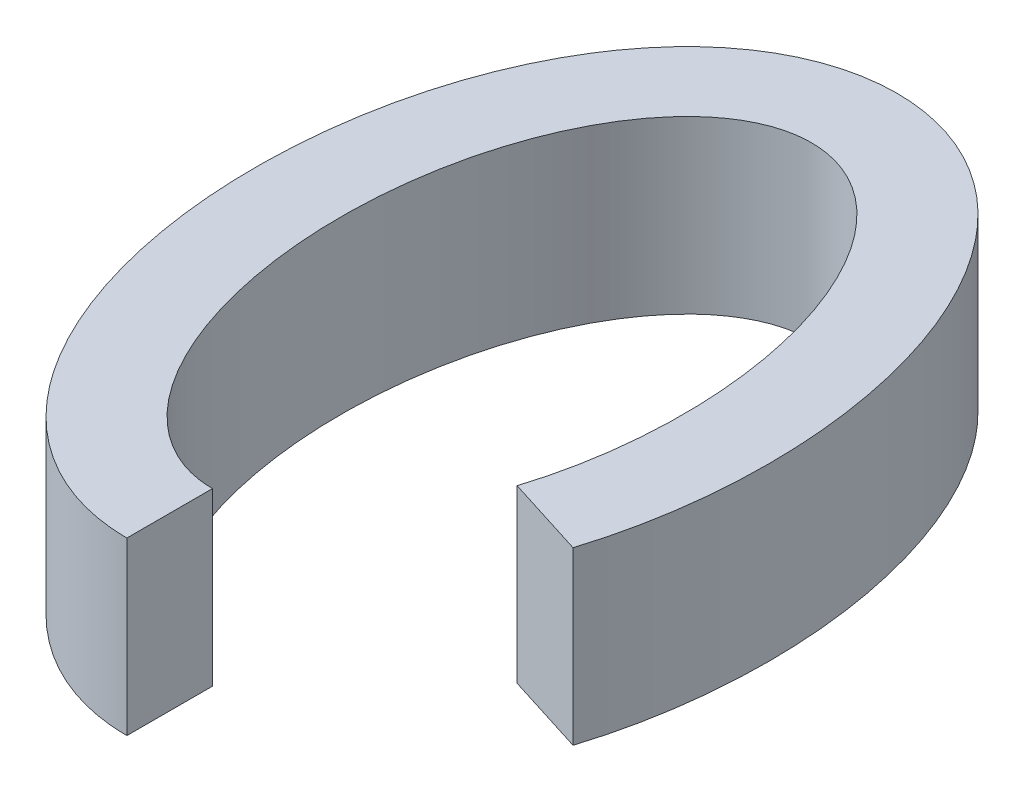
ISO-10303-21;
HEADER;
FILE_DESCRIPTION(('STEP AP214'),'2;1');
FILE_NAME('part.step','',(''),(''),'','','');
FILE_SCHEMA(('AUTOMOTIVE_DESIGN { 1 0 10303 214 1 1 1 1 }'));
ENDSEC;
DATA;
#1=APPLICATION_CONTEXT('core data for automotive mechanical design processes');
#2=APPLICATION_PROTOCOL_DEFINITION('international standard','automotive_design',2000,#1);
#3=PRODUCT_CONTEXT('',#1,'mechanical');
#4=PRODUCT('Part','Part','',(#3));
#5=PRODUCT_RELATED_PRODUCT_CATEGORY('part','',(#4));
#6=PRODUCT_DEFINITION_FORMATION('','',#4);
#7=PRODUCT_DEFINITION_CONTEXT('part definition',#1,'design');
#8=PRODUCT_DEFINITION('design','',#6,#7);
#9=PRODUCT_DEFINITION_SHAPE('','',#8);
#10=(LENGTH_UNIT() NAMED_UNIT(*) SI_UNIT(.MILLI.,.METRE.));
#11=(NAMED_UNIT(*) PLANE_ANGLE_UNIT() SI_UNIT($,.RADIAN.));
#12=(NAMED_UNIT(*) SI_UNIT($,.STERADIAN.) SOLID_ANGLE_UNIT());
#13=UNCERTAINTY_MEASURE_WITH_UNIT(LENGTH_MEASURE(1.E-05),#10,'distance_accuracy_value','');
#14=(GEOMETRIC_REPRESENTATION_CONTEXT(3) GLOBAL_UNCERTAINTY_ASSIGNED_CONTEXT((#13)) GLOBAL_UNIT_ASSIGNED_CONTEXT((#10,
#11,#12)) REPRESENTATION_CONTEXT('',''));
#15=CARTESIAN_POINT('',(0.,0.,0.));
#16=DIRECTION('',(0.,0.,1.));
#17=DIRECTION('',(1.,0.,0.));
#18=AXIS2_PLACEMENT_3D('',#15,#16,#17);
#19=CARTESIAN_POINT('',(27.0479201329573,20.,19.9173119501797));
#20=CARTESIAN_POINT('',(28.3196763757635,20.,15.8841766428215));
#21=CARTESIAN_POINT('',(29.180486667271,20.,11.602582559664));
#22=CARTESIAN_POINT('',(30.0809814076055,20.,2.85323177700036));
#23=CARTESIAN_POINT('',(30.1194336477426,20.,-1.61315339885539));
#24=CARTESIAN_POINT('',(29.3722141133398,20.,-10.3936884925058));
#25=CARTESIAN_POINT('',(28.5875556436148,20.,-14.7063774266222));
#26=CARTESIAN_POINT('',(26.1974756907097,20.,-22.8620090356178));
#27=CARTESIAN_POINT('',(24.5955267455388,20.,-26.7063630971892));
#28=CARTESIAN_POINT('',(21.534073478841,20.,-31.9105575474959));
#29=CARTESIAN_POINT('',(20.4028411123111,20.,-33.5519264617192));
#30=CARTESIAN_POINT('',(17.8969485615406,20.,-36.602957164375));
#31=CARTESIAN_POINT('',(16.5216592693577,20.,-38.0133403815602));
#32=CARTESIAN_POINT('',(13.5027838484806,20.,-40.5318010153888));
#33=CARTESIAN_POINT('',(11.8572890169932,20.,-41.6400149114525));
#34=CARTESIAN_POINT('',(8.30628481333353,20.,-43.4392087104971));
#35=CARTESIAN_POINT('',(6.39894596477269,20.,-44.1276396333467));
#36=CARTESIAN_POINT('',(3.42326957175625,20.,-44.7492157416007));
#37=CARTESIAN_POINT('',(2.41329529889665,20.,-44.888077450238));
#38=CARTESIAN_POINT('',(0.381037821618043,20.,-45.0207636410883));
#39=CARTESIAN_POINT('',(-0.641080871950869,20.,-45.0145390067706));
#40=CARTESIAN_POINT('',(-2.67112088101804,20.,-44.8573470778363));
#41=CARTESIAN_POINT('',(-3.67888150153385,20.,-44.706437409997));
#42=CARTESIAN_POINT('',(-5.65643928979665,20.,-44.269018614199));
#43=CARTESIAN_POINT('',(-6.62615460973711,20.,-43.9826357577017));
#44=CARTESIAN_POINT('',(-9.45264365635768,20.,-42.9426303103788));
#45=CARTESIAN_POINT('',(-11.2236327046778,20.,-42.0091574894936));
#46=CARTESIAN_POINT('',(-14.4886548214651,20.,-39.7912937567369));
#47=CARTESIAN_POINT('',(-15.9849950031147,20.,-38.50775706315));
#48=CARTESIAN_POINT('',(-18.7196495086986,20.,-35.682655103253));
#49=CARTESIAN_POINT('',(-19.9591312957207,20.,-34.1404315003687));
#50=CARTESIAN_POINT('',(-22.2073882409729,20.,-30.8513163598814));
#51=CARTESIAN_POINT('',(-23.2163700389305,20.,-29.1038308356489));
#52=CARTESIAN_POINT('',(-25.9227377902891,20.,-23.6101288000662));
#53=CARTESIAN_POINT('',(-27.302045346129,20.,-19.6107642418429));
#54=CARTESIAN_POINT('',(-29.2464871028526,20.,-11.2240614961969));
#55=CARTESIAN_POINT('',(-29.8087774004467,20.,-6.83666308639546));
#56=CARTESIAN_POINT('',(-30.1091362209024,20.,2.00179651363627));
#57=CARTESIAN_POINT('',(-29.846804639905,20.,6.45124289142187));
#58=CARTESIAN_POINT('',(-28.5004227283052,20.,15.0773827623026));
#59=CARTESIAN_POINT('',(-27.4182727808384,20.,19.2531068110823));
#60=CARTESIAN_POINT('',(-25.1735003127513,20.,25.0863560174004));
#61=CARTESIAN_POINT('',(-24.3213781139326,20.,26.9595110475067));
#62=CARTESIAN_POINT('',(-22.3998166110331,20.,30.5281685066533));
#63=CARTESIAN_POINT('',(-21.3304345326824,20.,32.2240254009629));
#64=CARTESIAN_POINT('',(-18.9551222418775,20.,35.3976966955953));
#65=CARTESIAN_POINT('',(-17.6488033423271,20.,36.8761838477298));
#66=CARTESIAN_POINT('',(-14.773586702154,20.,39.5539168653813));
#67=CARTESIAN_POINT('',(-13.2031476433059,20.,40.7536380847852));
#68=CARTESIAN_POINT('',(-9.79307549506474,20.,42.7713256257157));
#69=CARTESIAN_POINT('',(-7.95119787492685,20.,43.5876261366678));
#70=CARTESIAN_POINT('',(-5.04248096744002,20.,44.4248677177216));
#71=CARTESIAN_POINT('',(-4.04952848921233,20.,44.639343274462));
#72=CARTESIAN_POINT('',(-2.03765905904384,20.,44.9269580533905));
#73=CARTESIAN_POINT('',(-1.01887306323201,20.,45.));
#74=CARTESIAN_POINT('',(0.,20.,45.));
#75=B_SPLINE_CURVE_WITH_KNOTS('',3,(#19,#20,#21,#22,#23,#24,#25,#26,#27,#28,#29,#30,#31,#32,#33,
#34,#35,#36,#37,#38,#39,#40,#41,#42,#43,#44,#45,#46,#47,#48,#49,#50,#51,#52,#53,#54,#55,#56,#57,
#58,#59,#60,#61,#62,#63,#64,#65,#66,#67,#68,#69,#70,#71,#72,#73,#74),.UNSPECIFIED.,.F.,.F.,(4,2,
2,2,2,2,2,2,2,2,2,2,2,2,2,2,2,2,2,2,2,2,2,2,2,2,2,4),(0.,0.0624999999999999,0.125,0.1875,0.25,
0.28125,0.3125,0.34375,0.375,0.390625,0.40625,0.421875,0.4375,0.46875,0.5,0.53125,0.5625,0.625,
0.6875,0.75,0.8125,0.84375,0.875,0.90625,0.9375,0.96875,0.984375,1.),.UNSPECIFIED.);
#76=DIRECTION('',(0.,-1.,0.));
#77=VECTOR('',#76,1.);
#78=SURFACE_OF_LINEAR_EXTRUSION('',#75,#77);
#79=CARTESIAN_POINT('',(27.0479201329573,0.,19.9173119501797));
#80=CARTESIAN_POINT('',(28.3196763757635,0.,15.8841766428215));
#81=CARTESIAN_POINT('',(29.180486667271,0.,11.602582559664));
#82=CARTESIAN_POINT('',(30.0809814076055,0.,2.85323177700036));
#83=CARTESIAN_POINT('',(30.1194336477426,0.,-1.61315339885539));
#84=CARTESIAN_POINT('',(29.3722141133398,0.,-10.3936884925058));
#85=CARTESIAN_POINT('',(28.5875556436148,0.,-14.7063774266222));
#86=CARTESIAN_POINT('',(26.1974756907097,0.,-22.8620090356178));
#87=CARTESIAN_POINT('',(24.5955267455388,0.,-26.7063630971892));
#88=CARTESIAN_POINT('',(21.534073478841,0.,-31.9105575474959));
#89=CARTESIAN_POINT('',(20.4028411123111,0.,-33.5519264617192));
#90=CARTESIAN_POINT('',(17.8969485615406,0.,-36.602957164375));
#91=CARTESIAN_POINT('',(16.5216592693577,0.,-38.0133403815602));
#92=CARTESIAN_POINT('',(13.5027838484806,0.,-40.5318010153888));
#93=CARTESIAN_POINT('',(11.8572890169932,0.,-41.6400149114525));
#94=CARTESIAN_POINT('',(8.30628481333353,0.,-43.4392087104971));
#95=CARTESIAN_POINT('',(6.39894596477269,0.,-44.1276396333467));
#96=CARTESIAN_POINT('',(3.42326957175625,0.,-44.7492157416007));
#97=CARTESIAN_POINT('',(2.41329529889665,0.,-44.888077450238));
#98=CARTESIAN_POINT('',(0.381037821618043,0.,-45.0207636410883));
#99=CARTESIAN_POINT('',(-0.641080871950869,0.,-45.0145390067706));
#100=CARTESIAN_POINT('',(-2.67112088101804,0.,-44.8573470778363));
#101=CARTESIAN_POINT('',(-3.67888150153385,0.,-44.706437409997));
#102=CARTESIAN_POINT('',(-5.65643928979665,0.,-44.269018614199));
#103=CARTESIAN_POINT('',(-6.62615460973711,0.,-43.9826357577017));
#104=CARTESIAN_POINT('',(-9.45264365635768,0.,-42.9426303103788));
#105=CARTESIAN_POINT('',(-11.2236327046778,0.,-42.0091574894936));
#106=CARTESIAN_POINT('',(-14.4886548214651,0.,-39.7912937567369));
#107=CARTESIAN_POINT('',(-15.9849950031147,0.,-38.50775706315));
#108=CARTESIAN_POINT('',(-18.7196495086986,0.,-35.682655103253));
#109=CARTESIAN_POINT('',(-19.9591312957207,0.,-34.1404315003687));
#110=CARTESIAN_POINT('',(-22.2073882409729,0.,-30.8513163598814));
#111=CARTESIAN_POINT('',(-23.2163700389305,0.,-29.1038308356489));
#112=CARTESIAN_POINT('',(-25.9227377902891,0.,-23.6101288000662));
#113=CARTESIAN_POINT('',(-27.302045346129,0.,-19.6107642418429));
#114=CARTESIAN_POINT('',(-29.2464871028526,0.,-11.2240614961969));
#115=CARTESIAN_POINT('',(-29.8087774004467,0.,-6.83666308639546));
#116=CARTESIAN_POINT('',(-30.1091362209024,0.,2.00179651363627));
#117=CARTESIAN_POINT('',(-29.846804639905,0.,6.45124289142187));
#118=CARTESIAN_POINT('',(-28.5004227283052,0.,15.0773827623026));
#119=CARTESIAN_POINT('',(-27.4182727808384,0.,19.2531068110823));
#120=CARTESIAN_POINT('',(-25.1735003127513,0.,25.0863560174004));
#121=CARTESIAN_POINT('',(-24.3213781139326,0.,26.9595110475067));
#122=CARTESIAN_POINT('',(-22.3998166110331,0.,30.5281685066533));
#123=CARTESIAN_POINT('',(-21.3304345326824,0.,32.2240254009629));
#124=CARTESIAN_POINT('',(-18.9551222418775,0.,35.3976966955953));
#125=CARTESIAN_POINT('',(-17.6488033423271,0.,36.8761838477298));
#126=CARTESIAN_POINT('',(-14.773586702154,0.,39.5539168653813));
#127=CARTESIAN_POINT('',(-13.2031476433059,0.,40.7536380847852));
#128=CARTESIAN_POINT('',(-9.79307549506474,0.,42.7713256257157));
#129=CARTESIAN_POINT('',(-7.95119787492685,0.,43.5876261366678));
#130=CARTESIAN_POINT('',(-5.04248096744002,0.,44.4248677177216));
#131=CARTESIAN_POINT('',(-4.04952848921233,0.,44.639343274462));
#132=CARTESIAN_POINT('',(-2.03765905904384,0.,44.9269580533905));
#133=CARTESIAN_POINT('',(-1.01887306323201,0.,45.));
#134=CARTESIAN_POINT('',(0.,0.,45.));
#135=B_SPLINE_CURVE_WITH_KNOTS('',3,(#79,#80,#81,#82,#83,#84,#85,#86,#87,#88,#89,#90,#91,#92,
#93,#94,#95,#96,#97,#98,#99,#100,#101,#102,#103,#104,#105,#106,#107,#108,#109,#110,#111,#112,
#113,#114,#115,#116,#117,#118,#119,#120,#121,#122,#123,#124,#125,#126,#127,#128,#129,#130,#131,
#132,#133,#134),.UNSPECIFIED.,.F.,.F.,(4,2,2,2,2,2,2,2,2,2,2,2,2,2,2,2,2,2,2,2,2,2,2,2,2,2,2,4),
(0.,0.0624999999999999,0.125,0.1875,0.25,0.28125,0.3125,0.34375,0.375,0.390625,0.40625,0.421875,
0.4375,0.46875,0.5,0.53125,0.5625,0.625,0.6875,0.75,0.8125,0.84375,0.875,0.90625,0.9375,0.96875,
0.984375,1.),.UNSPECIFIED.);
#136=CARTESIAN_POINT('',(27.0479201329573,0.,19.9173119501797));
#137=VERTEX_POINT('',#136);
#138=CARTESIAN_POINT('',(0.,0.,45.));
#139=VERTEX_POINT('',#138);
#140=EDGE_CURVE('E85',#137,#139,#135,.T.);
#141=ORIENTED_EDGE('',*,*,#140,.T.);
#142=DIRECTION('',(0.,-1.,0.));
#143=VECTOR('',#142,1.);
#144=CARTESIAN_POINT('',(0.,20.,45.));
#145=LINE('',#144,#143);
#146=CARTESIAN_POINT('',(0.,20.,45.));
#147=VERTEX_POINT('',#146);
#148=EDGE_CURVE('E11',#147,#139,#145,.T.);
#149=ORIENTED_EDGE('',*,*,#148,.F.);
#150=CARTESIAN_POINT('',(27.0479201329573,20.,19.9173119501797));
#151=VERTEX_POINT('',#150);
#152=EDGE_CURVE('E97',#151,#147,#75,.T.);
#153=ORIENTED_EDGE('',*,*,#152,.F.);
#154=DIRECTION('',(0.,-1.,0.));
#155=VECTOR('',#154,1.);
#156=CARTESIAN_POINT('',(27.0479201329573,20.,19.9173119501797));
#157=LINE('',#156,#155);
#158=EDGE_CURVE('E48',#151,#137,#157,.T.);
#159=ORIENTED_EDGE('',*,*,#158,.T.);
#160=EDGE_LOOP('',(#141,#149,#153,#159));
#161=FACE_BOUND('',#160,.T.);
#162=ADVANCED_FACE('F33',(#161),#78,.F.);
#163=CARTESIAN_POINT('',(0.,20.,35.));
#164=DIRECTION('',(1.,0.,0.));
#165=DIRECTION('',(0.,0.,-1.));
#166=AXIS2_PLACEMENT_3D('',#163,#164,#165);
#167=PLANE('',#166);
#168=DIRECTION('',(0.,0.,1.));
#169=VECTOR('',#168,1.);
#170=CARTESIAN_POINT('',(0.,0.,35.));
#171=LINE('',#170,#169);
#172=CARTESIAN_POINT('',(0.,0.,35.));
#173=VERTEX_POINT('',#172);
#174=EDGE_CURVE('E79',#173,#139,#171,.T.);
#175=ORIENTED_EDGE('',*,*,#174,.F.);
#176=DIRECTION('',(0.,-1.,0.));
#177=VECTOR('',#176,1.);
#178=CARTESIAN_POINT('',(0.,20.,35.));
#179=LINE('',#178,#177);
#180=CARTESIAN_POINT('',(0.,20.,35.));
#181=VERTEX_POINT('',#180);
#182=EDGE_CURVE('E41',#181,#173,#179,.T.);
#183=ORIENTED_EDGE('',*,*,#182,.F.);
#184=DIRECTION('',(0.,0.,1.));
#185=VECTOR('',#184,1.);
#186=CARTESIAN_POINT('',(0.,20.,35.));
#187=LINE('',#186,#185);
#188=EDGE_CURVE('E82',#181,#147,#187,.T.);
#189=ORIENTED_EDGE('',*,*,#188,.T.);
#190=ORIENTED_EDGE('',*,*,#148,.T.);
#191=EDGE_LOOP('',(#175,#183,#189,#190));
#192=FACE_BOUND('',#191,.T.);
#193=ADVANCED_FACE('F77',(#192),#167,.T.);
#194=CARTESIAN_POINT('',(0.,20.,0.));
#195=DIRECTION('',(0.,1.,0.));
#196=DIRECTION('',(0.,0.,-1.));
#197=AXIS2_PLACEMENT_3D('',#194,#195,#196);
#198=ELLIPSE('',#197,35.,20.);
#199=DIRECTION('',(0.,-1.,0.));
#200=VECTOR('',#199,1.);
#201=SURFACE_OF_LINEAR_EXTRUSION('',#198,#200);
#202=CARTESIAN_POINT('',(0.,0.,0.));
#203=DIRECTION('',(0.,1.,0.));
#204=DIRECTION('',(0.,0.,-1.));
#205=AXIS2_PLACEMENT_3D('',#202,#203,#204);
#206=ELLIPSE('',#205,35.,20.);
#207=CARTESIAN_POINT('',(17.5108276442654,0.,16.9100096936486));
#208=VERTEX_POINT('',#207);
#209=EDGE_CURVE('E90',#208,#173,#206,.T.);
#210=ORIENTED_EDGE('',*,*,#209,.F.);
#211=DIRECTION('',(0.,-1.,0.));
#212=VECTOR('',#211,1.);
#213=CARTESIAN_POINT('',(17.5108276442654,20.,16.9100096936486));
#214=LINE('',#213,#212);
#215=CARTESIAN_POINT('',(17.5108276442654,20.,16.9100096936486));
#216=VERTEX_POINT('',#215);
#217=EDGE_CURVE('E56',#216,#208,#214,.T.);
#218=ORIENTED_EDGE('',*,*,#217,.F.);
#219=EDGE_CURVE('E106',#216,#181,#198,.T.);
#220=ORIENTED_EDGE('',*,*,#219,.T.);
#221=ORIENTED_EDGE('',*,*,#182,.T.);
#222=EDGE_LOOP('',(#210,#218,#220,#221));
#223=FACE_BOUND('',#222,.T.);
#224=ADVANCED_FACE('F112',(#223),#201,.T.);
#225=CARTESIAN_POINT('',(27.0479201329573,20.,19.9173119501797));
#226=DIRECTION('',(-0.300730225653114,0.,0.953709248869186));
#227=DIRECTION('',(0.953709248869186,0.,0.300730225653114));
#228=AXIS2_PLACEMENT_3D('',#225,#226,#227);
#229=PLANE('',#228);
#230=DIRECTION('',(-0.953709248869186,0.,-0.300730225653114));
#231=VECTOR('',#230,1.);
#232=CARTESIAN_POINT('',(27.0479201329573,0.,19.9173119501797));
#233=LINE('',#232,#231);
#234=EDGE_CURVE('E92',#137,#208,#233,.T.);
#235=ORIENTED_EDGE('',*,*,#234,.F.);
#236=ORIENTED_EDGE('',*,*,#158,.F.);
#237=DIRECTION('',(-0.953709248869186,0.,-0.300730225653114));
#238=VECTOR('',#237,1.);
#239=CARTESIAN_POINT('',(27.0479201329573,20.,19.9173119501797));
#240=LINE('',#239,#238);
#241=EDGE_CURVE('E109',#151,#216,#240,.T.);
#242=ORIENTED_EDGE('',*,*,#241,.T.);
#243=ORIENTED_EDGE('',*,*,#217,.T.);
#244=EDGE_LOOP('',(#235,#236,#242,#243));
#245=FACE_BOUND('',#244,.T.);
#246=ADVANCED_FACE('F115',(#245),#229,.T.);
#247=CARTESIAN_POINT('',(-17.3523222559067,20.,-37.0952060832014));
#248=DIRECTION('',(0.,-1.,0.));
#249=DIRECTION('',(0.,0.,-1.));
#250=AXIS2_PLACEMENT_3D('',#247,#248,#249);
#251=PLANE('',#250);
#252=ORIENTED_EDGE('',*,*,#152,.T.);
#253=ORIENTED_EDGE('',*,*,#188,.F.);
#254=ORIENTED_EDGE('',*,*,#219,.F.);
#255=ORIENTED_EDGE('',*,*,#241,.F.);
#256=EDGE_LOOP('',(#252,#253,#254,#255));
#257=FACE_BOUND('',#256,.T.);
#258=ADVANCED_FACE('F142',(#257),#251,.F.);
#259=CARTESIAN_POINT('',(-17.3523222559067,0.,-37.0952060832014));
#260=DIRECTION('',(0.,-1.,0.));
#261=DIRECTION('',(0.,0.,-1.));
#262=AXIS2_PLACEMENT_3D('',#259,#260,#261);
#263=PLANE('',#262);
#264=ORIENTED_EDGE('',*,*,#140,.F.);
#265=ORIENTED_EDGE('',*,*,#234,.T.);
#266=ORIENTED_EDGE('',*,*,#209,.T.);
#267=ORIENTED_EDGE('',*,*,#174,.T.);
#268=EDGE_LOOP('',(#264,#265,#266,#267));
#269=FACE_BOUND('',#268,.T.);
#270=ADVANCED_FACE('F89',(#269),#263,.T.);
#271=CLOSED_SHELL('',(#162,#193,#224,#246,#258,#270));
#272=MANIFOLD_SOLID_BREP('B2',#271);
#273=ADVANCED_BREP_SHAPE_REPRESENTATION('',(#18,#272),#14);
#274=SHAPE_DEFINITION_REPRESENTATION(#9,#273);
ENDSEC;
END-ISO-10303-21;
